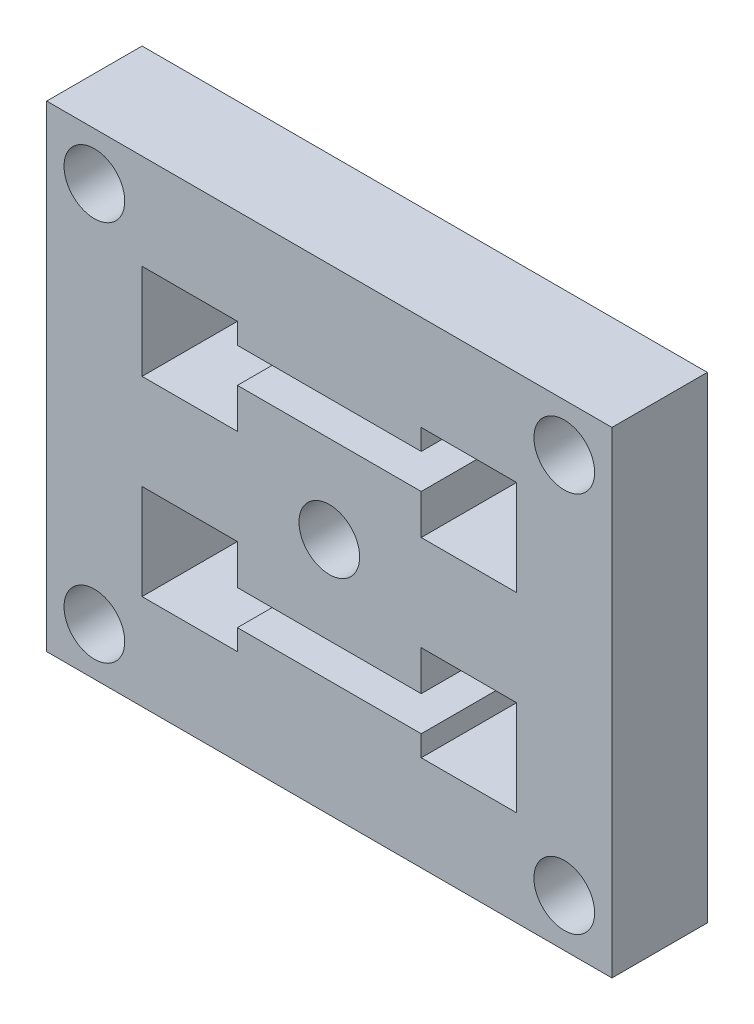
ISO-10303-21;
HEADER;
FILE_DESCRIPTION(('STEP AP214'),'2;1');
FILE_NAME('part.step','',(''),(''),'','','');
FILE_SCHEMA(('AUTOMOTIVE_DESIGN { 1 0 10303 214 1 1 1 1 }'));
ENDSEC;
DATA;
#1=APPLICATION_CONTEXT('core data for automotive mechanical design processes');
#2=APPLICATION_PROTOCOL_DEFINITION('international standard','automotive_design',2000,#1);
#3=PRODUCT_CONTEXT('',#1,'mechanical');
#4=PRODUCT('Part','Part','',(#3));
#5=PRODUCT_RELATED_PRODUCT_CATEGORY('part','',(#4));
#6=PRODUCT_DEFINITION_FORMATION('','',#4);
#7=PRODUCT_DEFINITION_CONTEXT('part definition',#1,'design');
#8=PRODUCT_DEFINITION('design','',#6,#7);
#9=PRODUCT_DEFINITION_SHAPE('','',#8);
#10=(LENGTH_UNIT() NAMED_UNIT(*) SI_UNIT(.MILLI.,.METRE.));
#11=(NAMED_UNIT(*) PLANE_ANGLE_UNIT() SI_UNIT($,.RADIAN.));
#12=(NAMED_UNIT(*) SI_UNIT($,.STERADIAN.) SOLID_ANGLE_UNIT());
#13=UNCERTAINTY_MEASURE_WITH_UNIT(LENGTH_MEASURE(1.E-05),#10,'distance_accuracy_value','');
#14=(GEOMETRIC_REPRESENTATION_CONTEXT(3) GLOBAL_UNCERTAINTY_ASSIGNED_CONTEXT((#13)) GLOBAL_UNIT_ASSIGNED_CONTEXT((#10,
#11,#12)) REPRESENTATION_CONTEXT('',''));
#15=CARTESIAN_POINT('',(0.,0.,0.));
#16=DIRECTION('',(0.,0.,1.));
#17=DIRECTION('',(1.,0.,0.));
#18=AXIS2_PLACEMENT_3D('',#15,#16,#17);
#19=CARTESIAN_POINT('',(0.,0.,5.5));
#20=DIRECTION('',(0.,0.,-1.));
#21=DIRECTION('',(-1.,0.,0.));
#22=AXIS2_PLACEMENT_3D('',#19,#20,#21);
#23=PLANE('',#22);
#24=DIRECTION('',(0.,1.,0.));
#25=VECTOR('',#24,1.);
#26=CARTESIAN_POINT('',(5.5,3.3,5.5));
#27=LINE('',#26,#25);
#28=CARTESIAN_POINT('',(5.5,-2.2,5.5));
#29=VERTEX_POINT('',#28);
#30=CARTESIAN_POINT('',(5.5,3.3,5.5));
#31=VERTEX_POINT('',#30);
#32=EDGE_CURVE('E357',#29,#31,#27,.T.);
#33=ORIENTED_EDGE('',*,*,#32,.F.);
#34=DIRECTION('',(1.,0.,0.));
#35=VECTOR('',#34,1.);
#36=CARTESIAN_POINT('',(5.5,-2.2,5.5));
#37=LINE('',#36,#35);
#38=CARTESIAN_POINT('',(0.,-2.2,5.5));
#39=VERTEX_POINT('',#38);
#40=EDGE_CURVE('E392',#39,#29,#37,.T.);
#41=ORIENTED_EDGE('',*,*,#40,.F.);
#42=DIRECTION('',(0.,-1.,0.));
#43=VECTOR('',#42,1.);
#44=CARTESIAN_POINT('',(0.,-1.,5.5));
#45=LINE('',#44,#43);
#46=CARTESIAN_POINT('',(0.,-1.,5.5));
#47=VERTEX_POINT('',#46);
#48=EDGE_CURVE('E388',#47,#39,#45,.T.);
#49=ORIENTED_EDGE('',*,*,#48,.F.);
#50=DIRECTION('',(1.,0.,0.));
#51=VECTOR('',#50,1.);
#52=CARTESIAN_POINT('',(-10.6,-1.,5.5));
#53=LINE('',#52,#51);
#54=CARTESIAN_POINT('',(-10.6,-1.,5.5));
#55=VERTEX_POINT('',#54);
#56=EDGE_CURVE('E385',#55,#47,#53,.T.);
#57=ORIENTED_EDGE('',*,*,#56,.F.);
#58=DIRECTION('',(0.,1.,0.));
#59=VECTOR('',#58,1.);
#60=CARTESIAN_POINT('',(-10.6,-2.2,5.5));
#61=LINE('',#60,#59);
#62=CARTESIAN_POINT('',(-10.6,-2.2,5.5));
#63=VERTEX_POINT('',#62);
#64=EDGE_CURVE('E382',#63,#55,#61,.T.);
#65=ORIENTED_EDGE('',*,*,#64,.F.);
#66=DIRECTION('',(1.,0.,0.));
#67=VECTOR('',#66,1.);
#68=CARTESIAN_POINT('',(-10.6,-2.2,5.5));
#69=LINE('',#68,#67);
#70=CARTESIAN_POINT('',(-16.1,-2.2,5.5));
#71=VERTEX_POINT('',#70);
#72=EDGE_CURVE('E379',#71,#63,#69,.T.);
#73=ORIENTED_EDGE('',*,*,#72,.F.);
#74=DIRECTION('',(0.,-1.,0.));
#75=VECTOR('',#74,1.);
#76=CARTESIAN_POINT('',(-16.1,-2.2,5.5));
#77=LINE('',#76,#75);
#78=CARTESIAN_POINT('',(-16.1,3.3,5.5));
#79=VERTEX_POINT('',#78);
#80=EDGE_CURVE('E376',#79,#71,#77,.T.);
#81=ORIENTED_EDGE('',*,*,#80,.F.);
#82=DIRECTION('',(-1.,0.,0.));
#83=VECTOR('',#82,1.);
#84=CARTESIAN_POINT('',(-16.1,3.3,5.5));
#85=LINE('',#84,#83);
#86=CARTESIAN_POINT('',(-10.6,3.3,5.5));
#87=VERTEX_POINT('',#86);
#88=EDGE_CURVE('E373',#87,#79,#85,.T.);
#89=ORIENTED_EDGE('',*,*,#88,.F.);
#90=DIRECTION('',(0.,1.,0.));
#91=VECTOR('',#90,1.);
#92=CARTESIAN_POINT('',(-10.6,3.3,5.5));
#93=LINE('',#92,#91);
#94=CARTESIAN_POINT('',(-10.6,1.,5.5));
#95=VERTEX_POINT('',#94);
#96=EDGE_CURVE('E370',#95,#87,#93,.T.);
#97=ORIENTED_EDGE('',*,*,#96,.F.);
#98=DIRECTION('',(-1.,0.,0.));
#99=VECTOR('',#98,1.);
#100=CARTESIAN_POINT('',(-10.6,1.,5.5));
#101=LINE('',#100,#99);
#102=CARTESIAN_POINT('',(0.,1.,5.5));
#103=VERTEX_POINT('',#102);
#104=EDGE_CURVE('E367',#103,#95,#101,.T.);
#105=ORIENTED_EDGE('',*,*,#104,.F.);
#106=DIRECTION('',(0.,-1.,0.));
#107=VECTOR('',#106,1.);
#108=CARTESIAN_POINT('',(0.,1.,5.5));
#109=LINE('',#108,#107);
#110=CARTESIAN_POINT('',(0.,3.3,5.5));
#111=VERTEX_POINT('',#110);
#112=EDGE_CURVE('E364',#111,#103,#109,.T.);
#113=ORIENTED_EDGE('',*,*,#112,.F.);
#114=DIRECTION('',(-1.,0.,0.));
#115=VECTOR('',#114,1.);
#116=CARTESIAN_POINT('',(0.,3.3,5.5));
#117=LINE('',#116,#115);
#118=EDGE_CURVE('E360',#31,#111,#117,.T.);
#119=ORIENTED_EDGE('',*,*,#118,.F.);
#120=EDGE_LOOP('',(#33,#41,#49,#57,#65,#73,#81,#89,#97,#105,#113,#119));
#121=FACE_BOUND('',#120,.T.);
#122=DIRECTION('',(0.,1.,0.));
#123=VECTOR('',#122,1.);
#124=CARTESIAN_POINT('',(11.,19.8,5.5));
#125=LINE('',#124,#123);
#126=CARTESIAN_POINT('',(11.,-7.7,5.5));
#127=VERTEX_POINT('',#126);
#128=CARTESIAN_POINT('',(11.,19.8,5.5));
#129=VERTEX_POINT('',#128);
#130=EDGE_CURVE('E480',#127,#129,#125,.T.);
#131=ORIENTED_EDGE('',*,*,#130,.T.);
#132=DIRECTION('',(-1.,0.,0.));
#133=VECTOR('',#132,1.);
#134=CARTESIAN_POINT('',(-21.6,19.8,5.5));
#135=LINE('',#134,#133);
#136=CARTESIAN_POINT('',(-21.6,19.8,5.5));
#137=VERTEX_POINT('',#136);
#138=EDGE_CURVE('E484',#129,#137,#135,.T.);
#139=ORIENTED_EDGE('',*,*,#138,.T.);
#140=DIRECTION('',(0.,-1.,0.));
#141=VECTOR('',#140,1.);
#142=CARTESIAN_POINT('',(-21.6,-7.7,5.5));
#143=LINE('',#142,#141);
#144=CARTESIAN_POINT('',(-21.6,-7.7,5.5));
#145=VERTEX_POINT('',#144);
#146=EDGE_CURVE('E488',#137,#145,#143,.T.);
#147=ORIENTED_EDGE('',*,*,#146,.T.);
#148=DIRECTION('',(1.,0.,0.));
#149=VECTOR('',#148,1.);
#150=CARTESIAN_POINT('',(11.,-7.7,5.5));
#151=LINE('',#150,#149);
#152=EDGE_CURVE('E491',#145,#127,#151,.T.);
#153=ORIENTED_EDGE('',*,*,#152,.T.);
#154=EDGE_LOOP('',(#131,#139,#147,#153));
#155=FACE_BOUND('',#154,.T.);
#156=DIRECTION('',(0.,-1.,0.));
#157=VECTOR('',#156,1.);
#158=CARTESIAN_POINT('',(0.,11.1,5.5));
#159=LINE('',#158,#157);
#160=CARTESIAN_POINT('',(0.,11.1,5.5));
#161=VERTEX_POINT('',#160);
#162=CARTESIAN_POINT('',(0.,8.8,5.5));
#163=VERTEX_POINT('',#162);
#164=EDGE_CURVE('E225',#161,#163,#159,.T.);
#165=ORIENTED_EDGE('',*,*,#164,.F.);
#166=DIRECTION('',(1.,0.,0.));
#167=VECTOR('',#166,1.);
#168=CARTESIAN_POINT('',(-10.6,11.1,5.5));
#169=LINE('',#168,#167);
#170=CARTESIAN_POINT('',(-10.6,11.1,5.5));
#171=VERTEX_POINT('',#170);
#172=EDGE_CURVE('E280',#171,#161,#169,.T.);
#173=ORIENTED_EDGE('',*,*,#172,.F.);
#174=DIRECTION('',(0.,1.,0.));
#175=VECTOR('',#174,1.);
#176=CARTESIAN_POINT('',(-10.6,8.8,5.5));
#177=LINE('',#176,#175);
#178=CARTESIAN_POINT('',(-10.6,8.8,5.5));
#179=VERTEX_POINT('',#178);
#180=EDGE_CURVE('E277',#179,#171,#177,.T.);
#181=ORIENTED_EDGE('',*,*,#180,.F.);
#182=DIRECTION('',(1.,0.,0.));
#183=VECTOR('',#182,1.);
#184=CARTESIAN_POINT('',(-10.6,8.8,5.5));
#185=LINE('',#184,#183);
#186=CARTESIAN_POINT('',(-16.1,8.8,5.5));
#187=VERTEX_POINT('',#186);
#188=EDGE_CURVE('E274',#187,#179,#185,.T.);
#189=ORIENTED_EDGE('',*,*,#188,.F.);
#190=DIRECTION('',(0.,-1.,0.));
#191=VECTOR('',#190,1.);
#192=CARTESIAN_POINT('',(-16.1,8.8,5.5));
#193=LINE('',#192,#191);
#194=CARTESIAN_POINT('',(-16.1,14.3,5.5));
#195=VERTEX_POINT('',#194);
#196=EDGE_CURVE('E271',#195,#187,#193,.T.);
#197=ORIENTED_EDGE('',*,*,#196,.F.);
#198=DIRECTION('',(-1.,0.,0.));
#199=VECTOR('',#198,1.);
#200=CARTESIAN_POINT('',(-16.1,14.3,5.5));
#201=LINE('',#200,#199);
#202=CARTESIAN_POINT('',(-10.6,14.3,5.5));
#203=VERTEX_POINT('',#202);
#204=EDGE_CURVE('E268',#203,#195,#201,.T.);
#205=ORIENTED_EDGE('',*,*,#204,.F.);
#206=DIRECTION('',(0.,1.,0.));
#207=VECTOR('',#206,1.);
#208=CARTESIAN_POINT('',(-10.6,14.3,5.5));
#209=LINE('',#208,#207);
#210=CARTESIAN_POINT('',(-10.6,13.1,5.5));
#211=VERTEX_POINT('',#210);
#212=EDGE_CURVE('E265',#211,#203,#209,.T.);
#213=ORIENTED_EDGE('',*,*,#212,.F.);
#214=DIRECTION('',(-1.,0.,0.));
#215=VECTOR('',#214,1.);
#216=CARTESIAN_POINT('',(-10.6,13.1,5.5));
#217=LINE('',#216,#215);
#218=CARTESIAN_POINT('',(0.,13.1,5.5));
#219=VERTEX_POINT('',#218);
#220=EDGE_CURVE('E262',#219,#211,#217,.T.);
#221=ORIENTED_EDGE('',*,*,#220,.F.);
#222=DIRECTION('',(0.,-1.,0.));
#223=VECTOR('',#222,1.);
#224=CARTESIAN_POINT('',(0.,13.1,5.5));
#225=LINE('',#224,#223);
#226=CARTESIAN_POINT('',(0.,14.3,5.5));
#227=VERTEX_POINT('',#226);
#228=EDGE_CURVE('E259',#227,#219,#225,.T.);
#229=ORIENTED_EDGE('',*,*,#228,.F.);
#230=DIRECTION('',(-1.,0.,0.));
#231=VECTOR('',#230,1.);
#232=CARTESIAN_POINT('',(0.,14.3,5.5));
#233=LINE('',#232,#231);
#234=CARTESIAN_POINT('',(5.5,14.3,5.5));
#235=VERTEX_POINT('',#234);
#236=EDGE_CURVE('E253',#235,#227,#233,.T.);
#237=ORIENTED_EDGE('',*,*,#236,.F.);
#238=DIRECTION('',(0.,1.,0.));
#239=VECTOR('',#238,1.);
#240=CARTESIAN_POINT('',(5.5,14.3,5.5));
#241=LINE('',#240,#239);
#242=CARTESIAN_POINT('',(5.5,8.8,5.5));
#243=VERTEX_POINT('',#242);
#244=EDGE_CURVE('E249',#243,#235,#241,.T.);
#245=ORIENTED_EDGE('',*,*,#244,.F.);
#246=DIRECTION('',(1.,0.,0.));
#247=VECTOR('',#246,1.);
#248=CARTESIAN_POINT('',(5.5,8.8,5.5));
#249=LINE('',#248,#247);
#250=EDGE_CURVE('E234',#163,#243,#249,.T.);
#251=ORIENTED_EDGE('',*,*,#250,.F.);
#252=EDGE_LOOP('',(#165,#173,#181,#189,#197,#205,#213,#221,#229,#237,#245,#251));
#253=FACE_BOUND('',#252,.T.);
#254=CARTESIAN_POINT('',(-5.3,6.05,5.5));
#255=DIRECTION('',(0.,0.,1.));
#256=DIRECTION('',(1.,0.,0.));
#257=AXIS2_PLACEMENT_3D('',#254,#255,#256);
#258=CIRCLE('',#257,1.75);
#259=CARTESIAN_POINT('',(-3.55,6.05,5.5));
#260=VERTEX_POINT('',#259);
#261=EDGE_CURVE('E285',#260,#260,#258,.T.);
#262=ORIENTED_EDGE('',*,*,#261,.F.);
#263=EDGE_LOOP('',(#262));
#264=FACE_BOUND('',#263,.T.);
#265=CARTESIAN_POINT('',(-18.85,-4.95,5.5));
#266=DIRECTION('',(0.,0.,1.));
#267=DIRECTION('',(1.,0.,0.));
#268=AXIS2_PLACEMENT_3D('',#265,#266,#267);
#269=CIRCLE('',#268,1.75);
#270=CARTESIAN_POINT('',(-17.1,-4.95,5.5));
#271=VERTEX_POINT('',#270);
#272=EDGE_CURVE('E882',#271,#271,#269,.T.);
#273=ORIENTED_EDGE('',*,*,#272,.F.);
#274=EDGE_LOOP('',(#273));
#275=FACE_BOUND('',#274,.T.);
#276=CARTESIAN_POINT('',(-18.85,17.05,5.5));
#277=DIRECTION('',(0.,0.,1.));
#278=DIRECTION('',(1.,0.,0.));
#279=AXIS2_PLACEMENT_3D('',#276,#277,#278);
#280=CIRCLE('',#279,1.75);
#281=CARTESIAN_POINT('',(-17.1,17.05,5.5));
#282=VERTEX_POINT('',#281);
#283=EDGE_CURVE('E874',#282,#282,#280,.T.);
#284=ORIENTED_EDGE('',*,*,#283,.F.);
#285=EDGE_LOOP('',(#284));
#286=FACE_BOUND('',#285,.T.);
#287=CARTESIAN_POINT('',(8.25,17.05,5.5));
#288=DIRECTION('',(0.,0.,1.));
#289=DIRECTION('',(1.,0.,0.));
#290=AXIS2_PLACEMENT_3D('',#287,#288,#289);
#291=CIRCLE('',#290,1.75);
#292=CARTESIAN_POINT('',(10.,17.05,5.5));
#293=VERTEX_POINT('',#292);
#294=EDGE_CURVE('E866',#293,#293,#291,.T.);
#295=ORIENTED_EDGE('',*,*,#294,.F.);
#296=EDGE_LOOP('',(#295));
#297=FACE_BOUND('',#296,.T.);
#298=CARTESIAN_POINT('',(8.25,-4.95,5.5));
#299=DIRECTION('',(0.,0.,1.));
#300=DIRECTION('',(1.,0.,0.));
#301=AXIS2_PLACEMENT_3D('',#298,#299,#300);
#302=CIRCLE('',#301,1.75);
#303=CARTESIAN_POINT('',(10.,-4.95,5.5));
#304=VERTEX_POINT('',#303);
#305=EDGE_CURVE('E855',#304,#304,#302,.T.);
#306=ORIENTED_EDGE('',*,*,#305,.F.);
#307=EDGE_LOOP('',(#306));
#308=FACE_BOUND('',#307,.T.);
#309=ADVANCED_FACE('F39',(#121,#155,#253,#264,#275,#286,#297,#308),#23,.F.);
#310=CARTESIAN_POINT('',(0.,0.,0.));
#311=DIRECTION('',(0.,0.,-1.));
#312=DIRECTION('',(-1.,0.,0.));
#313=AXIS2_PLACEMENT_3D('',#310,#311,#312);
#314=PLANE('',#313);
#315=CARTESIAN_POINT('',(8.25,17.05,0.));
#316=DIRECTION('',(0.,0.,1.));
#317=DIRECTION('',(1.,0.,0.));
#318=AXIS2_PLACEMENT_3D('',#315,#316,#317);
#319=CIRCLE('',#318,1.75);
#320=CARTESIAN_POINT('',(10.,17.05,0.));
#321=VERTEX_POINT('',#320);
#322=EDGE_CURVE('E863',#321,#321,#319,.T.);
#323=ORIENTED_EDGE('',*,*,#322,.T.);
#324=EDGE_LOOP('',(#323));
#325=FACE_BOUND('',#324,.T.);
#326=CARTESIAN_POINT('',(-18.85,-4.95,0.));
#327=DIRECTION('',(0.,0.,1.));
#328=DIRECTION('',(1.,0.,0.));
#329=AXIS2_PLACEMENT_3D('',#326,#327,#328);
#330=CIRCLE('',#329,1.75);
#331=CARTESIAN_POINT('',(-17.1,-4.95,0.));
#332=VERTEX_POINT('',#331);
#333=EDGE_CURVE('E878',#332,#332,#330,.T.);
#334=ORIENTED_EDGE('',*,*,#333,.T.);
#335=EDGE_LOOP('',(#334));
#336=FACE_BOUND('',#335,.T.);
#337=DIRECTION('',(1.,0.,0.));
#338=VECTOR('',#337,1.);
#339=CARTESIAN_POINT('',(-10.6,11.1,0.));
#340=LINE('',#339,#338);
#341=CARTESIAN_POINT('',(-10.6,11.1,0.));
#342=VERTEX_POINT('',#341);
#343=CARTESIAN_POINT('',(0.,11.1,0.));
#344=VERTEX_POINT('',#343);
#345=EDGE_CURVE('E235',#342,#344,#340,.T.);
#346=ORIENTED_EDGE('',*,*,#345,.T.);
#347=DIRECTION('',(0.,-1.,0.));
#348=VECTOR('',#347,1.);
#349=CARTESIAN_POINT('',(0.,11.1,0.));
#350=LINE('',#349,#348);
#351=CARTESIAN_POINT('',(0.,8.8,0.));
#352=VERTEX_POINT('',#351);
#353=EDGE_CURVE('E63',#344,#352,#350,.T.);
#354=ORIENTED_EDGE('',*,*,#353,.T.);
#355=DIRECTION('',(1.,0.,0.));
#356=VECTOR('',#355,1.);
#357=CARTESIAN_POINT('',(5.5,8.8,0.));
#358=LINE('',#357,#356);
#359=CARTESIAN_POINT('',(5.5,8.8,0.));
#360=VERTEX_POINT('',#359);
#361=EDGE_CURVE('E241',#352,#360,#358,.T.);
#362=ORIENTED_EDGE('',*,*,#361,.T.);
#363=DIRECTION('',(0.,1.,0.));
#364=VECTOR('',#363,1.);
#365=CARTESIAN_POINT('',(5.5,14.3,0.));
#366=LINE('',#365,#364);
#367=CARTESIAN_POINT('',(5.5,14.3,0.));
#368=VERTEX_POINT('',#367);
#369=EDGE_CURVE('E288',#360,#368,#366,.T.);
#370=ORIENTED_EDGE('',*,*,#369,.T.);
#371=DIRECTION('',(-1.,0.,0.));
#372=VECTOR('',#371,1.);
#373=CARTESIAN_POINT('',(0.,14.3,0.));
#374=LINE('',#373,#372);
#375=CARTESIAN_POINT('',(0.,14.3,0.));
#376=VERTEX_POINT('',#375);
#377=EDGE_CURVE('E292',#368,#376,#374,.T.);
#378=ORIENTED_EDGE('',*,*,#377,.T.);
#379=DIRECTION('',(0.,-1.,0.));
#380=VECTOR('',#379,1.);
#381=CARTESIAN_POINT('',(0.,13.1,0.));
#382=LINE('',#381,#380);
#383=CARTESIAN_POINT('',(0.,13.1,0.));
#384=VERTEX_POINT('',#383);
#385=EDGE_CURVE('E296',#376,#384,#382,.T.);
#386=ORIENTED_EDGE('',*,*,#385,.T.);
#387=DIRECTION('',(-1.,0.,0.));
#388=VECTOR('',#387,1.);
#389=CARTESIAN_POINT('',(-10.6,13.1,0.));
#390=LINE('',#389,#388);
#391=CARTESIAN_POINT('',(-10.6,13.1,0.));
#392=VERTEX_POINT('',#391);
#393=EDGE_CURVE('E300',#384,#392,#390,.T.);
#394=ORIENTED_EDGE('',*,*,#393,.T.);
#395=DIRECTION('',(0.,1.,0.));
#396=VECTOR('',#395,1.);
#397=CARTESIAN_POINT('',(-10.6,14.3,0.));
#398=LINE('',#397,#396);
#399=CARTESIAN_POINT('',(-10.6,14.3,0.));
#400=VERTEX_POINT('',#399);
#401=EDGE_CURVE('E304',#392,#400,#398,.T.);
#402=ORIENTED_EDGE('',*,*,#401,.T.);
#403=DIRECTION('',(-1.,0.,0.));
#404=VECTOR('',#403,1.);
#405=CARTESIAN_POINT('',(-16.1,14.3,0.));
#406=LINE('',#405,#404);
#407=CARTESIAN_POINT('',(-16.1,14.3,0.));
#408=VERTEX_POINT('',#407);
#409=EDGE_CURVE('E308',#400,#408,#406,.T.);
#410=ORIENTED_EDGE('',*,*,#409,.T.);
#411=DIRECTION('',(0.,-1.,0.));
#412=VECTOR('',#411,1.);
#413=CARTESIAN_POINT('',(-16.1,8.8,0.));
#414=LINE('',#413,#412);
#415=CARTESIAN_POINT('',(-16.1,8.8,0.));
#416=VERTEX_POINT('',#415);
#417=EDGE_CURVE('E312',#408,#416,#414,.T.);
#418=ORIENTED_EDGE('',*,*,#417,.T.);
#419=DIRECTION('',(1.,0.,0.));
#420=VECTOR('',#419,1.);
#421=CARTESIAN_POINT('',(-10.6,8.8,0.));
#422=LINE('',#421,#420);
#423=CARTESIAN_POINT('',(-10.6,8.8,0.));
#424=VERTEX_POINT('',#423);
#425=EDGE_CURVE('E316',#416,#424,#422,.T.);
#426=ORIENTED_EDGE('',*,*,#425,.T.);
#427=DIRECTION('',(0.,1.,0.));
#428=VECTOR('',#427,1.);
#429=CARTESIAN_POINT('',(-10.6,8.8,0.));
#430=LINE('',#429,#428);
#431=EDGE_CURVE('E320',#424,#342,#430,.T.);
#432=ORIENTED_EDGE('',*,*,#431,.T.);
#433=EDGE_LOOP('',(#346,#354,#362,#370,#378,#386,#394,#402,#410,#418,#426,#432));
#434=FACE_BOUND('',#433,.T.);
#435=DIRECTION('',(1.,0.,0.));
#436=VECTOR('',#435,1.);
#437=CARTESIAN_POINT('',(5.5,-2.2,0.));
#438=LINE('',#437,#436);
#439=CARTESIAN_POINT('',(0.,-2.2,0.));
#440=VERTEX_POINT('',#439);
#441=CARTESIAN_POINT('',(5.5,-2.2,0.));
#442=VERTEX_POINT('',#441);
#443=EDGE_CURVE('E361',#440,#442,#438,.T.);
#444=ORIENTED_EDGE('',*,*,#443,.T.);
#445=DIRECTION('',(0.,1.,0.));
#446=VECTOR('',#445,1.);
#447=CARTESIAN_POINT('',(5.5,3.3,0.));
#448=LINE('',#447,#446);
#449=CARTESIAN_POINT('',(5.5,3.3,0.));
#450=VERTEX_POINT('',#449);
#451=EDGE_CURVE('E243',#442,#450,#448,.T.);
#452=ORIENTED_EDGE('',*,*,#451,.T.);
#453=DIRECTION('',(-1.,0.,0.));
#454=VECTOR('',#453,1.);
#455=CARTESIAN_POINT('',(0.,3.3,0.));
#456=LINE('',#455,#454);
#457=CARTESIAN_POINT('',(0.,3.3,0.));
#458=VERTEX_POINT('',#457);
#459=EDGE_CURVE('E399',#450,#458,#456,.T.);
#460=ORIENTED_EDGE('',*,*,#459,.T.);
#461=DIRECTION('',(0.,-1.,0.));
#462=VECTOR('',#461,1.);
#463=CARTESIAN_POINT('',(0.,1.,0.));
#464=LINE('',#463,#462);
#465=CARTESIAN_POINT('',(0.,1.,0.));
#466=VERTEX_POINT('',#465);
#467=EDGE_CURVE('E403',#458,#466,#464,.T.);
#468=ORIENTED_EDGE('',*,*,#467,.T.);
#469=DIRECTION('',(-1.,0.,0.));
#470=VECTOR('',#469,1.);
#471=CARTESIAN_POINT('',(-10.6,1.,0.));
#472=LINE('',#471,#470);
#473=CARTESIAN_POINT('',(-10.6,1.,0.));
#474=VERTEX_POINT('',#473);
#475=EDGE_CURVE('E407',#466,#474,#472,.T.);
#476=ORIENTED_EDGE('',*,*,#475,.T.);
#477=DIRECTION('',(0.,1.,0.));
#478=VECTOR('',#477,1.);
#479=CARTESIAN_POINT('',(-10.6,3.3,0.));
#480=LINE('',#479,#478);
#481=CARTESIAN_POINT('',(-10.6,3.3,0.));
#482=VERTEX_POINT('',#481);
#483=EDGE_CURVE('E411',#474,#482,#480,.T.);
#484=ORIENTED_EDGE('',*,*,#483,.T.);
#485=DIRECTION('',(-1.,0.,0.));
#486=VECTOR('',#485,1.);
#487=CARTESIAN_POINT('',(-16.1,3.3,0.));
#488=LINE('',#487,#486);
#489=CARTESIAN_POINT('',(-16.1,3.3,0.));
#490=VERTEX_POINT('',#489);
#491=EDGE_CURVE('E415',#482,#490,#488,.T.);
#492=ORIENTED_EDGE('',*,*,#491,.T.);
#493=DIRECTION('',(0.,-1.,0.));
#494=VECTOR('',#493,1.);
#495=CARTESIAN_POINT('',(-16.1,-2.2,0.));
#496=LINE('',#495,#494);
#497=CARTESIAN_POINT('',(-16.1,-2.2,0.));
#498=VERTEX_POINT('',#497);
#499=EDGE_CURVE('E419',#490,#498,#496,.T.);
#500=ORIENTED_EDGE('',*,*,#499,.T.);
#501=DIRECTION('',(1.,0.,0.));
#502=VECTOR('',#501,1.);
#503=CARTESIAN_POINT('',(-10.6,-2.2,0.));
#504=LINE('',#503,#502);
#505=CARTESIAN_POINT('',(-10.6,-2.2,0.));
#506=VERTEX_POINT('',#505);
#507=EDGE_CURVE('E423',#498,#506,#504,.T.);
#508=ORIENTED_EDGE('',*,*,#507,.T.);
#509=DIRECTION('',(0.,1.,0.));
#510=VECTOR('',#509,1.);
#511=CARTESIAN_POINT('',(-10.6,-2.2,0.));
#512=LINE('',#511,#510);
#513=CARTESIAN_POINT('',(-10.6,-1.,0.));
#514=VERTEX_POINT('',#513);
#515=EDGE_CURVE('E427',#506,#514,#512,.T.);
#516=ORIENTED_EDGE('',*,*,#515,.T.);
#517=DIRECTION('',(1.,0.,0.));
#518=VECTOR('',#517,1.);
#519=CARTESIAN_POINT('',(-10.6,-1.,0.));
#520=LINE('',#519,#518);
#521=CARTESIAN_POINT('',(0.,-1.,0.));
#522=VERTEX_POINT('',#521);
#523=EDGE_CURVE('E431',#514,#522,#520,.T.);
#524=ORIENTED_EDGE('',*,*,#523,.T.);
#525=DIRECTION('',(0.,-1.,0.));
#526=VECTOR('',#525,1.);
#527=CARTESIAN_POINT('',(0.,-1.,0.));
#528=LINE('',#527,#526);
#529=EDGE_CURVE('E435',#522,#440,#528,.T.);
#530=ORIENTED_EDGE('',*,*,#529,.T.);
#531=EDGE_LOOP('',(#444,#452,#460,#468,#476,#484,#492,#500,#508,#516,#524,#530));
#532=FACE_BOUND('',#531,.T.);
#533=DIRECTION('',(0.,1.,0.));
#534=VECTOR('',#533,1.);
#535=CARTESIAN_POINT('',(11.,19.8,0.));
#536=LINE('',#535,#534);
#537=CARTESIAN_POINT('',(11.,-7.7,0.));
#538=VERTEX_POINT('',#537);
#539=CARTESIAN_POINT('',(11.,19.8,0.));
#540=VERTEX_POINT('',#539);
#541=EDGE_CURVE('E479',#538,#540,#536,.T.);
#542=ORIENTED_EDGE('',*,*,#541,.F.);
#543=DIRECTION('',(1.,0.,0.));
#544=VECTOR('',#543,1.);
#545=CARTESIAN_POINT('',(11.,-7.7,0.));
#546=LINE('',#545,#544);
#547=CARTESIAN_POINT('',(-21.6,-7.7,0.));
#548=VERTEX_POINT('',#547);
#549=EDGE_CURVE('E485',#548,#538,#546,.T.);
#550=ORIENTED_EDGE('',*,*,#549,.F.);
#551=DIRECTION('',(0.,-1.,0.));
#552=VECTOR('',#551,1.);
#553=CARTESIAN_POINT('',(-21.6,-7.7,0.));
#554=LINE('',#553,#552);
#555=CARTESIAN_POINT('',(-21.6,19.8,0.));
#556=VERTEX_POINT('',#555);
#557=EDGE_CURVE('E501',#556,#548,#554,.T.);
#558=ORIENTED_EDGE('',*,*,#557,.F.);
#559=DIRECTION('',(-1.,0.,0.));
#560=VECTOR('',#559,1.);
#561=CARTESIAN_POINT('',(-21.6,19.8,0.));
#562=LINE('',#561,#560);
#563=EDGE_CURVE('E498',#540,#556,#562,.T.);
#564=ORIENTED_EDGE('',*,*,#563,.F.);
#565=EDGE_LOOP('',(#542,#550,#558,#564));
#566=FACE_BOUND('',#565,.T.);
#567=CARTESIAN_POINT('',(-5.3,6.05,0.));
#568=DIRECTION('',(0.,0.,1.));
#569=DIRECTION('',(1.,0.,0.));
#570=AXIS2_PLACEMENT_3D('',#567,#568,#569);
#571=CIRCLE('',#570,1.75);
#572=CARTESIAN_POINT('',(-3.55,6.05,0.));
#573=VERTEX_POINT('',#572);
#574=EDGE_CURVE('E886',#573,#573,#571,.T.);
#575=ORIENTED_EDGE('',*,*,#574,.T.);
#576=EDGE_LOOP('',(#575));
#577=FACE_BOUND('',#576,.T.);
#578=CARTESIAN_POINT('',(-18.85,17.05,0.));
#579=DIRECTION('',(0.,0.,1.));
#580=DIRECTION('',(1.,0.,0.));
#581=AXIS2_PLACEMENT_3D('',#578,#579,#580);
#582=CIRCLE('',#581,1.75);
#583=CARTESIAN_POINT('',(-17.1,17.05,0.));
#584=VERTEX_POINT('',#583);
#585=EDGE_CURVE('E870',#584,#584,#582,.T.);
#586=ORIENTED_EDGE('',*,*,#585,.T.);
#587=EDGE_LOOP('',(#586));
#588=FACE_BOUND('',#587,.T.);
#589=CARTESIAN_POINT('',(8.25,-4.95,0.));
#590=DIRECTION('',(0.,0.,1.));
#591=DIRECTION('',(1.,0.,0.));
#592=AXIS2_PLACEMENT_3D('',#589,#590,#591);
#593=CIRCLE('',#592,1.75);
#594=CARTESIAN_POINT('',(10.,-4.95,0.));
#595=VERTEX_POINT('',#594);
#596=EDGE_CURVE('E858',#595,#595,#593,.T.);
#597=ORIENTED_EDGE('',*,*,#596,.T.);
#598=EDGE_LOOP('',(#597));
#599=FACE_BOUND('',#598,.T.);
#600=ADVANCED_FACE('F524',(#325,#336,#434,#532,#566,#577,#588,#599),#314,.T.);
#601=CARTESIAN_POINT('',(11.,19.8,5.5));
#602=DIRECTION('',(-1.,0.,0.));
#603=DIRECTION('',(0.,0.,1.));
#604=AXIS2_PLACEMENT_3D('',#601,#602,#603);
#605=PLANE('',#604);
#606=ORIENTED_EDGE('',*,*,#541,.T.);
#607=DIRECTION('',(0.,0.,-1.));
#608=VECTOR('',#607,1.);
#609=CARTESIAN_POINT('',(11.,19.8,5.5));
#610=LINE('',#609,#608);
#611=EDGE_CURVE('E11',#129,#540,#610,.T.);
#612=ORIENTED_EDGE('',*,*,#611,.F.);
#613=ORIENTED_EDGE('',*,*,#130,.F.);
#614=DIRECTION('',(0.,0.,-1.));
#615=VECTOR('',#614,1.);
#616=CARTESIAN_POINT('',(11.,-7.7,5.5));
#617=LINE('',#616,#615);
#618=EDGE_CURVE('E494',#127,#538,#617,.T.);
#619=ORIENTED_EDGE('',*,*,#618,.T.);
#620=EDGE_LOOP('',(#606,#612,#613,#619));
#621=FACE_BOUND('',#620,.T.);
#622=ADVANCED_FACE('F41',(#621),#605,.F.);
#623=CARTESIAN_POINT('',(-21.6,19.8,5.5));
#624=DIRECTION('',(0.,-1.,0.));
#625=DIRECTION('',(0.,0.,-1.));
#626=AXIS2_PLACEMENT_3D('',#623,#624,#625);
#627=PLANE('',#626);
#628=ORIENTED_EDGE('',*,*,#563,.T.);
#629=DIRECTION('',(0.,0.,-1.));
#630=VECTOR('',#629,1.);
#631=CARTESIAN_POINT('',(-21.6,19.8,5.5));
#632=LINE('',#631,#630);
#633=EDGE_CURVE('E48',#137,#556,#632,.T.);
#634=ORIENTED_EDGE('',*,*,#633,.F.);
#635=ORIENTED_EDGE('',*,*,#138,.F.);
#636=ORIENTED_EDGE('',*,*,#611,.T.);
#637=EDGE_LOOP('',(#628,#634,#635,#636));
#638=FACE_BOUND('',#637,.T.);
#639=ADVANCED_FACE('F534',(#638),#627,.F.);
#640=CARTESIAN_POINT('',(-21.6,-7.7,5.5));
#641=DIRECTION('',(1.,0.,0.));
#642=DIRECTION('',(0.,0.,-1.));
#643=AXIS2_PLACEMENT_3D('',#640,#641,#642);
#644=PLANE('',#643);
#645=ORIENTED_EDGE('',*,*,#557,.T.);
#646=DIRECTION('',(0.,0.,-1.));
#647=VECTOR('',#646,1.);
#648=CARTESIAN_POINT('',(-21.6,-7.7,5.5));
#649=LINE('',#648,#647);
#650=EDGE_CURVE('E509',#145,#548,#649,.T.);
#651=ORIENTED_EDGE('',*,*,#650,.F.);
#652=ORIENTED_EDGE('',*,*,#146,.F.);
#653=ORIENTED_EDGE('',*,*,#633,.T.);
#654=EDGE_LOOP('',(#645,#651,#652,#653));
#655=FACE_BOUND('',#654,.T.);
#656=ADVANCED_FACE('F518',(#655),#644,.F.);
#657=CARTESIAN_POINT('',(11.,-7.7,5.5));
#658=DIRECTION('',(0.,1.,0.));
#659=DIRECTION('',(0.,0.,1.));
#660=AXIS2_PLACEMENT_3D('',#657,#658,#659);
#661=PLANE('',#660);
#662=ORIENTED_EDGE('',*,*,#549,.T.);
#663=ORIENTED_EDGE('',*,*,#618,.F.);
#664=ORIENTED_EDGE('',*,*,#152,.F.);
#665=ORIENTED_EDGE('',*,*,#650,.T.);
#666=EDGE_LOOP('',(#662,#663,#664,#665));
#667=FACE_BOUND('',#666,.T.);
#668=ADVANCED_FACE('F528',(#667),#661,.F.);
#669=CARTESIAN_POINT('',(5.5,3.3,5.5));
#670=DIRECTION('',(-1.,0.,0.));
#671=DIRECTION('',(0.,0.,1.));
#672=AXIS2_PLACEMENT_3D('',#669,#670,#671);
#673=PLANE('',#672);
#674=ORIENTED_EDGE('',*,*,#451,.F.);
#675=DIRECTION('',(0.,0.,-1.));
#676=VECTOR('',#675,1.);
#677=CARTESIAN_POINT('',(5.5,-2.2,5.5));
#678=LINE('',#677,#676);
#679=EDGE_CURVE('E395',#29,#442,#678,.T.);
#680=ORIENTED_EDGE('',*,*,#679,.F.);
#681=ORIENTED_EDGE('',*,*,#32,.T.);
#682=DIRECTION('',(0.,0.,-1.));
#683=VECTOR('',#682,1.);
#684=CARTESIAN_POINT('',(5.5,3.3,5.5));
#685=LINE('',#684,#683);
#686=EDGE_CURVE('E475',#31,#450,#685,.T.);
#687=ORIENTED_EDGE('',*,*,#686,.T.);
#688=EDGE_LOOP('',(#674,#680,#681,#687));
#689=FACE_BOUND('',#688,.T.);
#690=ADVANCED_FACE('F551',(#689),#673,.T.);
#691=CARTESIAN_POINT('',(0.,3.3,5.5));
#692=DIRECTION('',(0.,-1.,0.));
#693=DIRECTION('',(0.,0.,-1.));
#694=AXIS2_PLACEMENT_3D('',#691,#692,#693);
#695=PLANE('',#694);
#696=ORIENTED_EDGE('',*,*,#459,.F.);
#697=ORIENTED_EDGE('',*,*,#686,.F.);
#698=ORIENTED_EDGE('',*,*,#118,.T.);
#699=DIRECTION('',(0.,0.,-1.));
#700=VECTOR('',#699,1.);
#701=CARTESIAN_POINT('',(0.,3.3,5.5));
#702=LINE('',#701,#700);
#703=EDGE_CURVE('E472',#111,#458,#702,.T.);
#704=ORIENTED_EDGE('',*,*,#703,.T.);
#705=EDGE_LOOP('',(#696,#697,#698,#704));
#706=FACE_BOUND('',#705,.T.);
#707=ADVANCED_FACE('F558',(#706),#695,.T.);
#708=CARTESIAN_POINT('',(0.,1.,5.5));
#709=DIRECTION('',(1.,0.,0.));
#710=DIRECTION('',(0.,0.,-1.));
#711=AXIS2_PLACEMENT_3D('',#708,#709,#710);
#712=PLANE('',#711);
#713=ORIENTED_EDGE('',*,*,#467,.F.);
#714=ORIENTED_EDGE('',*,*,#703,.F.);
#715=ORIENTED_EDGE('',*,*,#112,.T.);
#716=DIRECTION('',(0.,0.,-1.));
#717=VECTOR('',#716,1.);
#718=CARTESIAN_POINT('',(0.,1.,5.5));
#719=LINE('',#718,#717);
#720=EDGE_CURVE('E469',#103,#466,#719,.T.);
#721=ORIENTED_EDGE('',*,*,#720,.T.);
#722=EDGE_LOOP('',(#713,#714,#715,#721));
#723=FACE_BOUND('',#722,.T.);
#724=ADVANCED_FACE('F563',(#723),#712,.T.);
#725=CARTESIAN_POINT('',(-10.6,1.,5.5));
#726=DIRECTION('',(0.,-1.,0.));
#727=DIRECTION('',(1.,0.,0.));
#728=AXIS2_PLACEMENT_3D('',#725,#726,#727);
#729=PLANE('',#728);
#730=ORIENTED_EDGE('',*,*,#475,.F.);
#731=ORIENTED_EDGE('',*,*,#720,.F.);
#732=ORIENTED_EDGE('',*,*,#104,.T.);
#733=DIRECTION('',(0.,0.,-1.));
#734=VECTOR('',#733,1.);
#735=CARTESIAN_POINT('',(-10.6,1.,5.5));
#736=LINE('',#735,#734);
#737=EDGE_CURVE('E466',#95,#474,#736,.T.);
#738=ORIENTED_EDGE('',*,*,#737,.T.);
#739=EDGE_LOOP('',(#730,#731,#732,#738));
#740=FACE_BOUND('',#739,.T.);
#741=ADVANCED_FACE('F588',(#740),#729,.T.);
#742=CARTESIAN_POINT('',(-10.6,3.3,5.5));
#743=DIRECTION('',(-1.,0.,0.));
#744=DIRECTION('',(0.,0.,1.));
#745=AXIS2_PLACEMENT_3D('',#742,#743,#744);
#746=PLANE('',#745);
#747=ORIENTED_EDGE('',*,*,#483,.F.);
#748=ORIENTED_EDGE('',*,*,#737,.F.);
#749=ORIENTED_EDGE('',*,*,#96,.T.);
#750=DIRECTION('',(0.,0.,-1.));
#751=VECTOR('',#750,1.);
#752=CARTESIAN_POINT('',(-10.6,3.3,5.5));
#753=LINE('',#752,#751);
#754=EDGE_CURVE('E463',#87,#482,#753,.T.);
#755=ORIENTED_EDGE('',*,*,#754,.T.);
#756=EDGE_LOOP('',(#747,#748,#749,#755));
#757=FACE_BOUND('',#756,.T.);
#758=ADVANCED_FACE('F593',(#757),#746,.T.);
#759=CARTESIAN_POINT('',(-16.1,3.3,5.5));
#760=DIRECTION('',(0.,-1.,0.));
#761=DIRECTION('',(0.,0.,-1.));
#762=AXIS2_PLACEMENT_3D('',#759,#760,#761);
#763=PLANE('',#762);
#764=ORIENTED_EDGE('',*,*,#491,.F.);
#765=ORIENTED_EDGE('',*,*,#754,.F.);
#766=ORIENTED_EDGE('',*,*,#88,.T.);
#767=DIRECTION('',(0.,0.,-1.));
#768=VECTOR('',#767,1.);
#769=CARTESIAN_POINT('',(-16.1,3.3,5.5));
#770=LINE('',#769,#768);
#771=EDGE_CURVE('E460',#79,#490,#770,.T.);
#772=ORIENTED_EDGE('',*,*,#771,.T.);
#773=EDGE_LOOP('',(#764,#765,#766,#772));
#774=FACE_BOUND('',#773,.T.);
#775=ADVANCED_FACE('F598',(#774),#763,.T.);
#776=CARTESIAN_POINT('',(-16.1,-2.2,5.5));
#777=DIRECTION('',(1.,0.,0.));
#778=DIRECTION('',(0.,0.,-1.));
#779=AXIS2_PLACEMENT_3D('',#776,#777,#778);
#780=PLANE('',#779);
#781=ORIENTED_EDGE('',*,*,#499,.F.);
#782=ORIENTED_EDGE('',*,*,#771,.F.);
#783=ORIENTED_EDGE('',*,*,#80,.T.);
#784=DIRECTION('',(0.,0.,-1.));
#785=VECTOR('',#784,1.);
#786=CARTESIAN_POINT('',(-16.1,-2.2,5.5));
#787=LINE('',#786,#785);
#788=EDGE_CURVE('E457',#71,#498,#787,.T.);
#789=ORIENTED_EDGE('',*,*,#788,.T.);
#790=EDGE_LOOP('',(#781,#782,#783,#789));
#791=FACE_BOUND('',#790,.T.);
#792=ADVANCED_FACE('F603',(#791),#780,.T.);
#793=CARTESIAN_POINT('',(-10.6,-2.2,5.5));
#794=DIRECTION('',(0.,1.,0.));
#795=DIRECTION('',(0.,0.,1.));
#796=AXIS2_PLACEMENT_3D('',#793,#794,#795);
#797=PLANE('',#796);
#798=ORIENTED_EDGE('',*,*,#507,.F.);
#799=ORIENTED_EDGE('',*,*,#788,.F.);
#800=ORIENTED_EDGE('',*,*,#72,.T.);
#801=DIRECTION('',(0.,0.,-1.));
#802=VECTOR('',#801,1.);
#803=CARTESIAN_POINT('',(-10.6,-2.2,5.5));
#804=LINE('',#803,#802);
#805=EDGE_CURVE('E454',#63,#506,#804,.T.);
#806=ORIENTED_EDGE('',*,*,#805,.T.);
#807=EDGE_LOOP('',(#798,#799,#800,#806));
#808=FACE_BOUND('',#807,.T.);
#809=ADVANCED_FACE('F608',(#808),#797,.T.);
#810=CARTESIAN_POINT('',(-10.6,-2.2,5.5));
#811=DIRECTION('',(-1.,0.,0.));
#812=DIRECTION('',(0.,0.,1.));
#813=AXIS2_PLACEMENT_3D('',#810,#811,#812);
#814=PLANE('',#813);
#815=ORIENTED_EDGE('',*,*,#515,.F.);
#816=ORIENTED_EDGE('',*,*,#805,.F.);
#817=ORIENTED_EDGE('',*,*,#64,.T.);
#818=DIRECTION('',(0.,0.,-1.));
#819=VECTOR('',#818,1.);
#820=CARTESIAN_POINT('',(-10.6,-1.,5.5));
#821=LINE('',#820,#819);
#822=EDGE_CURVE('E451',#55,#514,#821,.T.);
#823=ORIENTED_EDGE('',*,*,#822,.T.);
#824=EDGE_LOOP('',(#815,#816,#817,#823));
#825=FACE_BOUND('',#824,.T.);
#826=ADVANCED_FACE('F612',(#825),#814,.T.);
#827=CARTESIAN_POINT('',(-10.6,-1.,5.5));
#828=DIRECTION('',(0.,1.,0.));
#829=DIRECTION('',(0.,0.,1.));
#830=AXIS2_PLACEMENT_3D('',#827,#828,#829);
#831=PLANE('',#830);
#832=ORIENTED_EDGE('',*,*,#523,.F.);
#833=ORIENTED_EDGE('',*,*,#822,.F.);
#834=ORIENTED_EDGE('',*,*,#56,.T.);
#835=DIRECTION('',(0.,0.,-1.));
#836=VECTOR('',#835,1.);
#837=CARTESIAN_POINT('',(0.,-1.,5.5));
#838=LINE('',#837,#836);
#839=EDGE_CURVE('E448',#47,#522,#838,.T.);
#840=ORIENTED_EDGE('',*,*,#839,.T.);
#841=EDGE_LOOP('',(#832,#833,#834,#840));
#842=FACE_BOUND('',#841,.T.);
#843=ADVANCED_FACE('F616',(#842),#831,.T.);
#844=CARTESIAN_POINT('',(0.,-1.,5.5));
#845=DIRECTION('',(1.,0.,0.));
#846=DIRECTION('',(0.,0.,-1.));
#847=AXIS2_PLACEMENT_3D('',#844,#845,#846);
#848=PLANE('',#847);
#849=ORIENTED_EDGE('',*,*,#529,.F.);
#850=ORIENTED_EDGE('',*,*,#839,.F.);
#851=ORIENTED_EDGE('',*,*,#48,.T.);
#852=DIRECTION('',(0.,0.,-1.));
#853=VECTOR('',#852,1.);
#854=CARTESIAN_POINT('',(0.,-2.2,5.5));
#855=LINE('',#854,#853);
#856=EDGE_CURVE('E445',#39,#440,#855,.T.);
#857=ORIENTED_EDGE('',*,*,#856,.T.);
#858=EDGE_LOOP('',(#849,#850,#851,#857));
#859=FACE_BOUND('',#858,.T.);
#860=ADVANCED_FACE('F576',(#859),#848,.T.);
#861=CARTESIAN_POINT('',(5.5,-2.2,5.5));
#862=DIRECTION('',(0.,1.,0.));
#863=DIRECTION('',(0.,0.,1.));
#864=AXIS2_PLACEMENT_3D('',#861,#862,#863);
#865=PLANE('',#864);
#866=ORIENTED_EDGE('',*,*,#443,.F.);
#867=ORIENTED_EDGE('',*,*,#856,.F.);
#868=ORIENTED_EDGE('',*,*,#40,.T.);
#869=ORIENTED_EDGE('',*,*,#679,.T.);
#870=EDGE_LOOP('',(#866,#867,#868,#869));
#871=FACE_BOUND('',#870,.T.);
#872=ADVANCED_FACE('F570',(#871),#865,.T.);
#873=CARTESIAN_POINT('',(0.,11.1,5.5));
#874=DIRECTION('',(1.,0.,0.));
#875=DIRECTION('',(0.,0.,-1.));
#876=AXIS2_PLACEMENT_3D('',#873,#874,#875);
#877=PLANE('',#876);
#878=ORIENTED_EDGE('',*,*,#353,.F.);
#879=DIRECTION('',(0.,0.,-1.));
#880=VECTOR('',#879,1.);
#881=CARTESIAN_POINT('',(0.,11.1,5.5));
#882=LINE('',#881,#880);
#883=EDGE_CURVE('E229',#161,#344,#882,.T.);
#884=ORIENTED_EDGE('',*,*,#883,.F.);
#885=ORIENTED_EDGE('',*,*,#164,.T.);
#886=DIRECTION('',(0.,0.,-1.));
#887=VECTOR('',#886,1.);
#888=CARTESIAN_POINT('',(0.,8.8,5.5));
#889=LINE('',#888,#887);
#890=EDGE_CURVE('E228',#163,#352,#889,.T.);
#891=ORIENTED_EDGE('',*,*,#890,.T.);
#892=EDGE_LOOP('',(#878,#884,#885,#891));
#893=FACE_BOUND('',#892,.T.);
#894=ADVANCED_FACE('F227',(#893),#877,.T.);
#895=CARTESIAN_POINT('',(5.5,8.8,5.5));
#896=DIRECTION('',(0.,1.,0.));
#897=DIRECTION('',(0.,0.,1.));
#898=AXIS2_PLACEMENT_3D('',#895,#896,#897);
#899=PLANE('',#898);
#900=ORIENTED_EDGE('',*,*,#361,.F.);
#901=ORIENTED_EDGE('',*,*,#890,.F.);
#902=ORIENTED_EDGE('',*,*,#250,.T.);
#903=DIRECTION('',(0.,0.,-1.));
#904=VECTOR('',#903,1.);
#905=CARTESIAN_POINT('',(5.5,8.8,5.5));
#906=LINE('',#905,#904);
#907=EDGE_CURVE('E244',#243,#360,#906,.T.);
#908=ORIENTED_EDGE('',*,*,#907,.T.);
#909=EDGE_LOOP('',(#900,#901,#902,#908));
#910=FACE_BOUND('',#909,.T.);
#911=ADVANCED_FACE('F238',(#910),#899,.T.);
#912=CARTESIAN_POINT('',(5.5,14.3,5.5));
#913=DIRECTION('',(-1.,0.,0.));
#914=DIRECTION('',(0.,0.,1.));
#915=AXIS2_PLACEMENT_3D('',#912,#913,#914);
#916=PLANE('',#915);
#917=ORIENTED_EDGE('',*,*,#369,.F.);
#918=ORIENTED_EDGE('',*,*,#907,.F.);
#919=ORIENTED_EDGE('',*,*,#244,.T.);
#920=DIRECTION('',(0.,0.,-1.));
#921=VECTOR('',#920,1.);
#922=CARTESIAN_POINT('',(5.5,14.3,5.5));
#923=LINE('',#922,#921);
#924=EDGE_CURVE('E352',#235,#368,#923,.T.);
#925=ORIENTED_EDGE('',*,*,#924,.T.);
#926=EDGE_LOOP('',(#917,#918,#919,#925));
#927=FACE_BOUND('',#926,.T.);
#928=ADVANCED_FACE('F700',(#927),#916,.T.);
#929=CARTESIAN_POINT('',(0.,14.3,5.5));
#930=DIRECTION('',(0.,-1.,0.));
#931=DIRECTION('',(0.,0.,-1.));
#932=AXIS2_PLACEMENT_3D('',#929,#930,#931);
#933=PLANE('',#932);
#934=ORIENTED_EDGE('',*,*,#377,.F.);
#935=ORIENTED_EDGE('',*,*,#924,.F.);
#936=ORIENTED_EDGE('',*,*,#236,.T.);
#937=DIRECTION('',(0.,0.,-1.));
#938=VECTOR('',#937,1.);
#939=CARTESIAN_POINT('',(0.,14.3,5.5));
#940=LINE('',#939,#938);
#941=EDGE_CURVE('E349',#227,#376,#940,.T.);
#942=ORIENTED_EDGE('',*,*,#941,.T.);
#943=EDGE_LOOP('',(#934,#935,#936,#942));
#944=FACE_BOUND('',#943,.T.);
#945=ADVANCED_FACE('F709',(#944),#933,.T.);
#946=CARTESIAN_POINT('',(0.,13.1,5.5));
#947=DIRECTION('',(1.,0.,0.));
#948=DIRECTION('',(0.,0.,-1.));
#949=AXIS2_PLACEMENT_3D('',#946,#947,#948);
#950=PLANE('',#949);
#951=ORIENTED_EDGE('',*,*,#385,.F.);
#952=ORIENTED_EDGE('',*,*,#941,.F.);
#953=ORIENTED_EDGE('',*,*,#228,.T.);
#954=DIRECTION('',(0.,0.,-1.));
#955=VECTOR('',#954,1.);
#956=CARTESIAN_POINT('',(0.,13.1,5.5));
#957=LINE('',#956,#955);
#958=EDGE_CURVE('E346',#219,#384,#957,.T.);
#959=ORIENTED_EDGE('',*,*,#958,.T.);
#960=EDGE_LOOP('',(#951,#952,#953,#959));
#961=FACE_BOUND('',#960,.T.);
#962=ADVANCED_FACE('F719',(#961),#950,.T.);
#963=CARTESIAN_POINT('',(-10.6,13.1,5.5));
#964=DIRECTION('',(0.,-1.,0.));
#965=DIRECTION('',(0.,0.,-1.));
#966=AXIS2_PLACEMENT_3D('',#963,#964,#965);
#967=PLANE('',#966);
#968=ORIENTED_EDGE('',*,*,#393,.F.);
#969=ORIENTED_EDGE('',*,*,#958,.F.);
#970=ORIENTED_EDGE('',*,*,#220,.T.);
#971=DIRECTION('',(0.,0.,-1.));
#972=VECTOR('',#971,1.);
#973=CARTESIAN_POINT('',(-10.6,13.1,5.5));
#974=LINE('',#973,#972);
#975=EDGE_CURVE('E343',#211,#392,#974,.T.);
#976=ORIENTED_EDGE('',*,*,#975,.T.);
#977=EDGE_LOOP('',(#968,#969,#970,#976));
#978=FACE_BOUND('',#977,.T.);
#979=ADVANCED_FACE('F729',(#978),#967,.T.);
#980=CARTESIAN_POINT('',(-10.6,14.3,5.5));
#981=DIRECTION('',(-1.,0.,0.));
#982=DIRECTION('',(0.,0.,1.));
#983=AXIS2_PLACEMENT_3D('',#980,#981,#982);
#984=PLANE('',#983);
#985=ORIENTED_EDGE('',*,*,#401,.F.);
#986=ORIENTED_EDGE('',*,*,#975,.F.);
#987=ORIENTED_EDGE('',*,*,#212,.T.);
#988=DIRECTION('',(0.,0.,-1.));
#989=VECTOR('',#988,1.);
#990=CARTESIAN_POINT('',(-10.6,14.3,5.5));
#991=LINE('',#990,#989);
#992=EDGE_CURVE('E340',#203,#400,#991,.T.);
#993=ORIENTED_EDGE('',*,*,#992,.T.);
#994=EDGE_LOOP('',(#985,#986,#987,#993));
#995=FACE_BOUND('',#994,.T.);
#996=ADVANCED_FACE('F739',(#995),#984,.T.);
#997=CARTESIAN_POINT('',(-16.1,14.3,5.5));
#998=DIRECTION('',(0.,-1.,0.));
#999=DIRECTION('',(0.,0.,-1.));
#1000=AXIS2_PLACEMENT_3D('',#997,#998,#999);
#1001=PLANE('',#1000);
#1002=ORIENTED_EDGE('',*,*,#409,.F.);
#1003=ORIENTED_EDGE('',*,*,#992,.F.);
#1004=ORIENTED_EDGE('',*,*,#204,.T.);
#1005=DIRECTION('',(0.,0.,-1.));
#1006=VECTOR('',#1005,1.);
#1007=CARTESIAN_POINT('',(-16.1,14.3,5.5));
#1008=LINE('',#1007,#1006);
#1009=EDGE_CURVE('E337',#195,#408,#1008,.T.);
#1010=ORIENTED_EDGE('',*,*,#1009,.T.);
#1011=EDGE_LOOP('',(#1002,#1003,#1004,#1010));
#1012=FACE_BOUND('',#1011,.T.);
#1013=ADVANCED_FACE('F749',(#1012),#1001,.T.);
#1014=CARTESIAN_POINT('',(-16.1,8.8,5.5));
#1015=DIRECTION('',(1.,0.,0.));
#1016=DIRECTION('',(0.,0.,-1.));
#1017=AXIS2_PLACEMENT_3D('',#1014,#1015,#1016);
#1018=PLANE('',#1017);
#1019=ORIENTED_EDGE('',*,*,#417,.F.);
#1020=ORIENTED_EDGE('',*,*,#1009,.F.);
#1021=ORIENTED_EDGE('',*,*,#196,.T.);
#1022=DIRECTION('',(0.,0.,-1.));
#1023=VECTOR('',#1022,1.);
#1024=CARTESIAN_POINT('',(-16.1,8.8,5.5));
#1025=LINE('',#1024,#1023);
#1026=EDGE_CURVE('E334',#187,#416,#1025,.T.);
#1027=ORIENTED_EDGE('',*,*,#1026,.T.);
#1028=EDGE_LOOP('',(#1019,#1020,#1021,#1027));
#1029=FACE_BOUND('',#1028,.T.);
#1030=ADVANCED_FACE('F759',(#1029),#1018,.T.);
#1031=CARTESIAN_POINT('',(-10.6,8.8,5.5));
#1032=DIRECTION('',(0.,1.,0.));
#1033=DIRECTION('',(0.,0.,1.));
#1034=AXIS2_PLACEMENT_3D('',#1031,#1032,#1033);
#1035=PLANE('',#1034);
#1036=ORIENTED_EDGE('',*,*,#425,.F.);
#1037=ORIENTED_EDGE('',*,*,#1026,.F.);
#1038=ORIENTED_EDGE('',*,*,#188,.T.);
#1039=DIRECTION('',(0.,0.,-1.));
#1040=VECTOR('',#1039,1.);
#1041=CARTESIAN_POINT('',(-10.6,8.8,5.5));
#1042=LINE('',#1041,#1040);
#1043=EDGE_CURVE('E331',#179,#424,#1042,.T.);
#1044=ORIENTED_EDGE('',*,*,#1043,.T.);
#1045=EDGE_LOOP('',(#1036,#1037,#1038,#1044));
#1046=FACE_BOUND('',#1045,.T.);
#1047=ADVANCED_FACE('F769',(#1046),#1035,.T.);
#1048=CARTESIAN_POINT('',(-10.6,8.8,5.5));
#1049=DIRECTION('',(-1.,0.,0.));
#1050=DIRECTION('',(0.,0.,1.));
#1051=AXIS2_PLACEMENT_3D('',#1048,#1049,#1050);
#1052=PLANE('',#1051);
#1053=ORIENTED_EDGE('',*,*,#431,.F.);
#1054=ORIENTED_EDGE('',*,*,#1043,.F.);
#1055=ORIENTED_EDGE('',*,*,#180,.T.);
#1056=DIRECTION('',(0.,0.,-1.));
#1057=VECTOR('',#1056,1.);
#1058=CARTESIAN_POINT('',(-10.6,11.1,5.5));
#1059=LINE('',#1058,#1057);
#1060=EDGE_CURVE('E55',#171,#342,#1059,.T.);
#1061=ORIENTED_EDGE('',*,*,#1060,.T.);
#1062=EDGE_LOOP('',(#1053,#1054,#1055,#1061));
#1063=FACE_BOUND('',#1062,.T.);
#1064=ADVANCED_FACE('F779',(#1063),#1052,.T.);
#1065=CARTESIAN_POINT('',(-10.6,11.1,5.5));
#1066=DIRECTION('',(0.,1.,0.));
#1067=DIRECTION('',(0.,0.,1.));
#1068=AXIS2_PLACEMENT_3D('',#1065,#1066,#1067);
#1069=PLANE('',#1068);
#1070=ORIENTED_EDGE('',*,*,#345,.F.);
#1071=ORIENTED_EDGE('',*,*,#1060,.F.);
#1072=ORIENTED_EDGE('',*,*,#172,.T.);
#1073=ORIENTED_EDGE('',*,*,#883,.T.);
#1074=EDGE_LOOP('',(#1070,#1071,#1072,#1073));
#1075=FACE_BOUND('',#1074,.T.);
#1076=ADVANCED_FACE('F789',(#1075),#1069,.T.);
#1077=CARTESIAN_POINT('',(-5.3,6.05,5.5));
#1078=DIRECTION('',(0.,0.,-1.));
#1079=DIRECTION('',(-1.,0.,0.));
#1080=AXIS2_PLACEMENT_3D('',#1077,#1078,#1079);
#1081=CYLINDRICAL_SURFACE('',#1080,1.75);
#1082=ORIENTED_EDGE('',*,*,#261,.T.);
#1083=EDGE_LOOP('',(#1082));
#1084=FACE_BOUND('',#1083,.T.);
#1085=ORIENTED_EDGE('',*,*,#574,.F.);
#1086=EDGE_LOOP('',(#1085));
#1087=FACE_BOUND('',#1086,.T.);
#1088=ADVANCED_FACE('F799',(#1084,#1087),#1081,.F.);
#1089=CARTESIAN_POINT('',(-18.85,-4.95,5.5));
#1090=DIRECTION('',(0.,0.,-1.));
#1091=DIRECTION('',(-1.,0.,0.));
#1092=AXIS2_PLACEMENT_3D('',#1089,#1090,#1091);
#1093=CYLINDRICAL_SURFACE('',#1092,1.75);
#1094=ORIENTED_EDGE('',*,*,#272,.T.);
#1095=EDGE_LOOP('',(#1094));
#1096=FACE_BOUND('',#1095,.T.);
#1097=ORIENTED_EDGE('',*,*,#333,.F.);
#1098=EDGE_LOOP('',(#1097));
#1099=FACE_BOUND('',#1098,.T.);
#1100=ADVANCED_FACE('F808',(#1096,#1099),#1093,.F.);
#1101=CARTESIAN_POINT('',(-18.85,17.05,5.5));
#1102=DIRECTION('',(0.,0.,-1.));
#1103=DIRECTION('',(-1.,0.,0.));
#1104=AXIS2_PLACEMENT_3D('',#1101,#1102,#1103);
#1105=CYLINDRICAL_SURFACE('',#1104,1.75);
#1106=ORIENTED_EDGE('',*,*,#283,.T.);
#1107=EDGE_LOOP('',(#1106));
#1108=FACE_BOUND('',#1107,.T.);
#1109=ORIENTED_EDGE('',*,*,#585,.F.);
#1110=EDGE_LOOP('',(#1109));
#1111=FACE_BOUND('',#1110,.T.);
#1112=ADVANCED_FACE('F818',(#1108,#1111),#1105,.F.);
#1113=CARTESIAN_POINT('',(8.25,17.05,5.5));
#1114=DIRECTION('',(0.,0.,-1.));
#1115=DIRECTION('',(-1.,0.,0.));
#1116=AXIS2_PLACEMENT_3D('',#1113,#1114,#1115);
#1117=CYLINDRICAL_SURFACE('',#1116,1.75);
#1118=ORIENTED_EDGE('',*,*,#294,.T.);
#1119=EDGE_LOOP('',(#1118));
#1120=FACE_BOUND('',#1119,.T.);
#1121=ORIENTED_EDGE('',*,*,#322,.F.);
#1122=EDGE_LOOP('',(#1121));
#1123=FACE_BOUND('',#1122,.T.);
#1124=ADVANCED_FACE('F828',(#1120,#1123),#1117,.F.);
#1125=CARTESIAN_POINT('',(8.25,-4.95,5.5));
#1126=DIRECTION('',(0.,0.,-1.));
#1127=DIRECTION('',(-1.,0.,0.));
#1128=AXIS2_PLACEMENT_3D('',#1125,#1126,#1127);
#1129=CYLINDRICAL_SURFACE('',#1128,1.75);
#1130=ORIENTED_EDGE('',*,*,#305,.T.);
#1131=EDGE_LOOP('',(#1130));
#1132=FACE_BOUND('',#1131,.T.);
#1133=ORIENTED_EDGE('',*,*,#596,.F.);
#1134=EDGE_LOOP('',(#1133));
#1135=FACE_BOUND('',#1134,.T.);
#1136=ADVANCED_FACE('F838',(#1132,#1135),#1129,.F.);
#1137=CLOSED_SHELL('',(#309,#600,#622,#639,#656,#668,#690,#707,#724,#741,#758,#775,#792,#809,
#826,#843,#860,#872,#894,#911,#928,#945,#962,#979,#996,#1013,#1030,#1047,#1064,#1076,#1088,
#1100,#1112,#1124,#1136));
#1138=MANIFOLD_SOLID_BREP('B2',#1137);
#1139=ADVANCED_BREP_SHAPE_REPRESENTATION('',(#18,#1138),#14);
#1140=SHAPE_DEFINITION_REPRESENTATION(#9,#1139);
ENDSEC;
END-ISO-10303-21;
